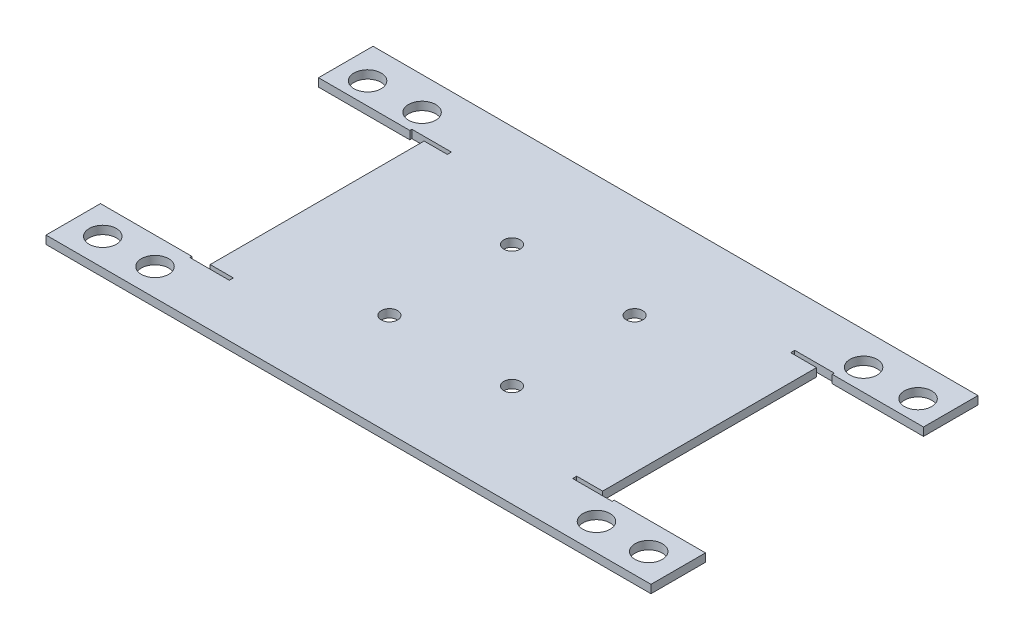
ISO-10303-21;
HEADER;
FILE_DESCRIPTION(('STEP AP214'),'2;1');
FILE_NAME('part.step','',(''),(''),'','','');
FILE_SCHEMA(('AUTOMOTIVE_DESIGN { 1 0 10303 214 1 1 1 1 }'));
ENDSEC;
DATA;
#1=APPLICATION_CONTEXT('core data for automotive mechanical design processes');
#2=APPLICATION_PROTOCOL_DEFINITION('international standard','automotive_design',2000,#1);
#3=PRODUCT_CONTEXT('',#1,'mechanical');
#4=PRODUCT('Part','Part','',(#3));
#5=PRODUCT_RELATED_PRODUCT_CATEGORY('part','',(#4));
#6=PRODUCT_DEFINITION_FORMATION('','',#4);
#7=PRODUCT_DEFINITION_CONTEXT('part definition',#1,'design');
#8=PRODUCT_DEFINITION('design','',#6,#7);
#9=PRODUCT_DEFINITION_SHAPE('','',#8);
#10=(LENGTH_UNIT() NAMED_UNIT(*) SI_UNIT(.MILLI.,.METRE.));
#11=(NAMED_UNIT(*) PLANE_ANGLE_UNIT() SI_UNIT($,.RADIAN.));
#12=(NAMED_UNIT(*) SI_UNIT($,.STERADIAN.) SOLID_ANGLE_UNIT());
#13=UNCERTAINTY_MEASURE_WITH_UNIT(LENGTH_MEASURE(1.E-05),#10,'distance_accuracy_value','');
#14=(GEOMETRIC_REPRESENTATION_CONTEXT(3) GLOBAL_UNCERTAINTY_ASSIGNED_CONTEXT((#13)) GLOBAL_UNIT_ASSIGNED_CONTEXT((#10,
#11,#12)) REPRESENTATION_CONTEXT('',''));
#15=CARTESIAN_POINT('',(0.,0.,0.));
#16=DIRECTION('',(0.,0.,1.));
#17=DIRECTION('',(1.,0.,0.));
#18=AXIS2_PLACEMENT_3D('',#15,#16,#17);
#19=CARTESIAN_POINT('',(0.,1.,0.));
#20=DIRECTION('',(0.,0.,-1.));
#21=DIRECTION('',(1.,0.,0.));
#22=AXIS2_PLACEMENT_3D('',#19,#20,#21);
#23=PLANE('',#22);
#24=DIRECTION('',(1.,0.,0.));
#25=VECTOR('',#24,1.);
#26=CARTESIAN_POINT('',(0.,1.,0.));
#27=LINE('',#26,#25);
#28=CARTESIAN_POINT('',(-19.7488935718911,1.,0.));
#29=VERTEX_POINT('',#28);
#30=CARTESIAN_POINT('',(91.2488935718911,1.,0.));
#31=VERTEX_POINT('',#30);
#32=EDGE_CURVE('E268',#29,#31,#27,.T.);
#33=ORIENTED_EDGE('',*,*,#32,.F.);
#34=DIRECTION('',(0.,1.,0.));
#35=VECTOR('',#34,1.);
#36=CARTESIAN_POINT('',(-19.7488935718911,1.,0.));
#37=LINE('',#36,#35);
#38=CARTESIAN_POINT('',(-19.7488935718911,-0.499999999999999,0.));
#39=VERTEX_POINT('',#38);
#40=EDGE_CURVE('E290',#39,#29,#37,.T.);
#41=ORIENTED_EDGE('',*,*,#40,.F.);
#42=DIRECTION('',(1.,0.,0.));
#43=VECTOR('',#42,1.);
#44=CARTESIAN_POINT('',(0.,-0.5,0.));
#45=LINE('',#44,#43);
#46=CARTESIAN_POINT('',(91.2488935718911,-0.5,0.));
#47=VERTEX_POINT('',#46);
#48=EDGE_CURVE('E142',#39,#47,#45,.T.);
#49=ORIENTED_EDGE('',*,*,#48,.T.);
#50=DIRECTION('',(0.,1.,0.));
#51=VECTOR('',#50,1.);
#52=CARTESIAN_POINT('',(91.2488935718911,1.,0.));
#53=LINE('',#52,#51);
#54=EDGE_CURVE('E407',#47,#31,#53,.T.);
#55=ORIENTED_EDGE('',*,*,#54,.T.);
#56=EDGE_LOOP('',(#33,#41,#49,#55));
#57=FACE_BOUND('',#56,.T.);
#58=ADVANCED_FACE('F43',(#57),#23,.F.);
#59=CARTESIAN_POINT('',(0.,1.,-9.625));
#60=DIRECTION('',(0.,0.,1.));
#61=DIRECTION('',(-1.,0.,0.));
#62=AXIS2_PLACEMENT_3D('',#59,#60,#61);
#63=PLANE('',#62);
#64=DIRECTION('',(-1.,0.,0.));
#65=VECTOR('',#64,1.);
#66=CARTESIAN_POINT('',(0.,1.,-9.625));
#67=LINE('',#66,#65);
#68=CARTESIAN_POINT('',(74.498893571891,1.,-9.625));
#69=VERTEX_POINT('',#68);
#70=CARTESIAN_POINT('',(67.25,1.,-9.625));
#71=VERTEX_POINT('',#70);
#72=EDGE_CURVE('E200',#69,#71,#67,.T.);
#73=ORIENTED_EDGE('',*,*,#72,.F.);
#74=DIRECTION('',(0.,1.,0.));
#75=VECTOR('',#74,1.);
#76=CARTESIAN_POINT('',(74.498893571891,1.,-9.625));
#77=LINE('',#76,#75);
#78=CARTESIAN_POINT('',(74.498893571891,-0.5,-9.625));
#79=VERTEX_POINT('',#78);
#80=EDGE_CURVE('E133',#79,#69,#77,.T.);
#81=ORIENTED_EDGE('',*,*,#80,.F.);
#82=DIRECTION('',(1.,0.,0.));
#83=VECTOR('',#82,1.);
#84=CARTESIAN_POINT('',(0.,-0.5,-9.625));
#85=LINE('',#84,#83);
#86=CARTESIAN_POINT('',(67.25,-0.5,-9.625));
#87=VERTEX_POINT('',#86);
#88=EDGE_CURVE('E125',#79,#87,#85,.F.);
#89=ORIENTED_EDGE('',*,*,#88,.T.);
#90=DIRECTION('',(0.,1.,0.));
#91=VECTOR('',#90,1.);
#92=CARTESIAN_POINT('',(67.25,1.,-9.625));
#93=LINE('',#92,#91);
#94=EDGE_CURVE('E12',#87,#71,#93,.T.);
#95=ORIENTED_EDGE('',*,*,#94,.T.);
#96=EDGE_LOOP('',(#73,#81,#89,#95));
#97=FACE_BOUND('',#96,.T.);
#98=ADVANCED_FACE('F131',(#97),#63,.F.);
#99=CARTESIAN_POINT('',(67.25,1.,0.));
#100=DIRECTION('',(-1.,0.,0.));
#101=DIRECTION('',(0.,0.,-1.));
#102=AXIS2_PLACEMENT_3D('',#99,#100,#101);
#103=PLANE('',#102);
#104=ORIENTED_EDGE('',*,*,#94,.F.);
#105=DIRECTION('',(0.,0.,-1.));
#106=VECTOR('',#105,1.);
#107=CARTESIAN_POINT('',(67.25,-0.5,0.));
#108=LINE('',#107,#106);
#109=CARTESIAN_POINT('',(67.25,-0.5,-10.375));
#110=VERTEX_POINT('',#109);
#111=EDGE_CURVE('E110',#87,#110,#108,.T.);
#112=ORIENTED_EDGE('',*,*,#111,.T.);
#113=DIRECTION('',(0.,1.,0.));
#114=VECTOR('',#113,1.);
#115=CARTESIAN_POINT('',(67.25,1.,-10.375));
#116=LINE('',#115,#114);
#117=CARTESIAN_POINT('',(67.25,1.,-10.375));
#118=VERTEX_POINT('',#117);
#119=EDGE_CURVE('E52',#110,#118,#116,.T.);
#120=ORIENTED_EDGE('',*,*,#119,.T.);
#121=DIRECTION('',(0.,0.,-1.));
#122=VECTOR('',#121,1.);
#123=CARTESIAN_POINT('',(67.25,1.,0.));
#124=LINE('',#123,#122);
#125=EDGE_CURVE('E113',#71,#118,#124,.T.);
#126=ORIENTED_EDGE('',*,*,#125,.F.);
#127=EDGE_LOOP('',(#104,#112,#120,#126));
#128=FACE_BOUND('',#127,.T.);
#129=ADVANCED_FACE('F109',(#128),#103,.F.);
#130=CARTESIAN_POINT('',(0.,1.,-10.375));
#131=DIRECTION('',(0.,0.,-1.));
#132=DIRECTION('',(1.,0.,0.));
#133=AXIS2_PLACEMENT_3D('',#130,#131,#132);
#134=PLANE('',#133);
#135=ORIENTED_EDGE('',*,*,#119,.F.);
#136=DIRECTION('',(1.,0.,0.));
#137=VECTOR('',#136,1.);
#138=CARTESIAN_POINT('',(0.,-0.5,-10.375));
#139=LINE('',#138,#137);
#140=CARTESIAN_POINT('',(72.,-0.5,-10.375));
#141=VERTEX_POINT('',#140);
#142=EDGE_CURVE('E128',#110,#141,#139,.T.);
#143=ORIENTED_EDGE('',*,*,#142,.T.);
#144=DIRECTION('',(0.,1.,0.));
#145=VECTOR('',#144,1.);
#146=CARTESIAN_POINT('',(72.,1.,-10.375));
#147=LINE('',#146,#145);
#148=CARTESIAN_POINT('',(72.,1.,-10.375));
#149=VERTEX_POINT('',#148);
#150=EDGE_CURVE('E186',#141,#149,#147,.T.);
#151=ORIENTED_EDGE('',*,*,#150,.T.);
#152=DIRECTION('',(1.,0.,0.));
#153=VECTOR('',#152,1.);
#154=CARTESIAN_POINT('',(0.,1.,-10.375));
#155=LINE('',#154,#153);
#156=EDGE_CURVE('E197',#118,#149,#155,.T.);
#157=ORIENTED_EDGE('',*,*,#156,.F.);
#158=EDGE_LOOP('',(#135,#143,#151,#157));
#159=FACE_BOUND('',#158,.T.);
#160=ADVANCED_FACE('F203',(#159),#134,.F.);
#161=CARTESIAN_POINT('',(72.,1.,0.));
#162=DIRECTION('',(-1.,0.,0.));
#163=DIRECTION('',(0.,0.,-1.));
#164=AXIS2_PLACEMENT_3D('',#161,#162,#163);
#165=PLANE('',#164);
#166=ORIENTED_EDGE('',*,*,#150,.F.);
#167=DIRECTION('',(0.,0.,-1.));
#168=VECTOR('',#167,1.);
#169=CARTESIAN_POINT('',(72.,-0.5,0.));
#170=LINE('',#169,#168);
#171=CARTESIAN_POINT('',(72.,-0.5,-49.625));
#172=VERTEX_POINT('',#171);
#173=EDGE_CURVE('E160',#141,#172,#170,.T.);
#174=ORIENTED_EDGE('',*,*,#173,.T.);
#175=DIRECTION('',(0.,1.,0.));
#176=VECTOR('',#175,1.);
#177=CARTESIAN_POINT('',(72.,1.,-49.625));
#178=LINE('',#177,#176);
#179=CARTESIAN_POINT('',(72.,1.,-49.625));
#180=VERTEX_POINT('',#179);
#181=EDGE_CURVE('E183',#172,#180,#178,.T.);
#182=ORIENTED_EDGE('',*,*,#181,.T.);
#183=DIRECTION('',(0.,0.,-1.));
#184=VECTOR('',#183,1.);
#185=CARTESIAN_POINT('',(72.,1.,0.));
#186=LINE('',#185,#184);
#187=EDGE_CURVE('E277',#149,#180,#186,.T.);
#188=ORIENTED_EDGE('',*,*,#187,.F.);
#189=EDGE_LOOP('',(#166,#174,#182,#188));
#190=FACE_BOUND('',#189,.T.);
#191=ADVANCED_FACE('F252',(#190),#165,.F.);
#192=CARTESIAN_POINT('',(0.,1.,-49.6249999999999));
#193=DIRECTION('',(0.,0.,1.));
#194=DIRECTION('',(-1.,0.,0.));
#195=AXIS2_PLACEMENT_3D('',#192,#193,#194);
#196=PLANE('',#195);
#197=ORIENTED_EDGE('',*,*,#181,.F.);
#198=DIRECTION('',(1.,0.,0.));
#199=VECTOR('',#198,1.);
#200=CARTESIAN_POINT('',(0.,-0.5,-49.625));
#201=LINE('',#200,#199);
#202=CARTESIAN_POINT('',(67.25,-0.5,-49.625));
#203=VERTEX_POINT('',#202);
#204=EDGE_CURVE('E129',#172,#203,#201,.F.);
#205=ORIENTED_EDGE('',*,*,#204,.T.);
#206=DIRECTION('',(0.,1.,0.));
#207=VECTOR('',#206,1.);
#208=CARTESIAN_POINT('',(67.25,1.,-49.625));
#209=LINE('',#208,#207);
#210=CARTESIAN_POINT('',(67.25,1.,-49.625));
#211=VERTEX_POINT('',#210);
#212=EDGE_CURVE('E180',#203,#211,#209,.T.);
#213=ORIENTED_EDGE('',*,*,#212,.T.);
#214=DIRECTION('',(-1.,0.,0.));
#215=VECTOR('',#214,1.);
#216=CARTESIAN_POINT('',(0.,1.,-49.6249999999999));
#217=LINE('',#216,#215);
#218=EDGE_CURVE('E201',#180,#211,#217,.T.);
#219=ORIENTED_EDGE('',*,*,#218,.F.);
#220=EDGE_LOOP('',(#197,#205,#213,#219));
#221=FACE_BOUND('',#220,.T.);
#222=ADVANCED_FACE('F256',(#221),#196,.F.);
#223=CARTESIAN_POINT('',(67.2500000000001,1.,0.));
#224=DIRECTION('',(-1.,0.,0.));
#225=DIRECTION('',(0.,0.,-1.));
#226=AXIS2_PLACEMENT_3D('',#223,#224,#225);
#227=PLANE('',#226);
#228=ORIENTED_EDGE('',*,*,#212,.F.);
#229=DIRECTION('',(0.,0.,-1.));
#230=VECTOR('',#229,1.);
#231=CARTESIAN_POINT('',(67.25,-0.5,0.));
#232=LINE('',#231,#230);
#233=CARTESIAN_POINT('',(67.25,-0.5,-50.375));
#234=VERTEX_POINT('',#233);
#235=EDGE_CURVE('E145',#203,#234,#232,.T.);
#236=ORIENTED_EDGE('',*,*,#235,.T.);
#237=DIRECTION('',(0.,1.,0.));
#238=VECTOR('',#237,1.);
#239=CARTESIAN_POINT('',(67.25,1.,-50.375));
#240=LINE('',#239,#238);
#241=CARTESIAN_POINT('',(67.25,1.,-50.375));
#242=VERTEX_POINT('',#241);
#243=EDGE_CURVE('E177',#234,#242,#240,.T.);
#244=ORIENTED_EDGE('',*,*,#243,.T.);
#245=DIRECTION('',(0.,0.,-1.));
#246=VECTOR('',#245,1.);
#247=CARTESIAN_POINT('',(67.2500000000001,1.,0.));
#248=LINE('',#247,#246);
#249=EDGE_CURVE('E265',#211,#242,#248,.T.);
#250=ORIENTED_EDGE('',*,*,#249,.F.);
#251=EDGE_LOOP('',(#228,#236,#244,#250));
#252=FACE_BOUND('',#251,.T.);
#253=ADVANCED_FACE('F724',(#252),#227,.F.);
#254=CARTESIAN_POINT('',(0.,1.,-50.3749999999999));
#255=DIRECTION('',(0.,0.,-1.));
#256=DIRECTION('',(1.,0.,0.));
#257=AXIS2_PLACEMENT_3D('',#254,#255,#256);
#258=PLANE('',#257);
#259=ORIENTED_EDGE('',*,*,#243,.F.);
#260=DIRECTION('',(1.,0.,0.));
#261=VECTOR('',#260,1.);
#262=CARTESIAN_POINT('',(0.,-0.5,-50.375));
#263=LINE('',#262,#261);
#264=CARTESIAN_POINT('',(74.498893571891,-0.5,-50.375));
#265=VERTEX_POINT('',#264);
#266=EDGE_CURVE('E243',#234,#265,#263,.T.);
#267=ORIENTED_EDGE('',*,*,#266,.T.);
#268=DIRECTION('',(0.,1.,0.));
#269=VECTOR('',#268,1.);
#270=CARTESIAN_POINT('',(74.498893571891,1.,-50.375));
#271=LINE('',#270,#269);
#272=CARTESIAN_POINT('',(74.498893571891,1.,-50.375));
#273=VERTEX_POINT('',#272);
#274=EDGE_CURVE('E445',#265,#273,#271,.T.);
#275=ORIENTED_EDGE('',*,*,#274,.T.);
#276=DIRECTION('',(1.,0.,0.));
#277=VECTOR('',#276,1.);
#278=CARTESIAN_POINT('',(0.,1.,-50.3749999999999));
#279=LINE('',#278,#277);
#280=EDGE_CURVE('E263',#242,#273,#279,.T.);
#281=ORIENTED_EDGE('',*,*,#280,.F.);
#282=EDGE_LOOP('',(#259,#267,#275,#281));
#283=FACE_BOUND('',#282,.T.);
#284=ADVANCED_FACE('F473',(#283),#258,.F.);
#285=CARTESIAN_POINT('',(0.,1.,-60.));
#286=DIRECTION('',(0.,0.,1.));
#287=DIRECTION('',(-1.,0.,0.));
#288=AXIS2_PLACEMENT_3D('',#285,#286,#287);
#289=PLANE('',#288);
#290=DIRECTION('',(-1.,0.,0.));
#291=VECTOR('',#290,1.);
#292=CARTESIAN_POINT('',(0.,1.,-60.));
#293=LINE('',#292,#291);
#294=CARTESIAN_POINT('',(91.248893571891,1.,-60.));
#295=VERTEX_POINT('',#294);
#296=CARTESIAN_POINT('',(-19.7488935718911,1.,-60.));
#297=VERTEX_POINT('',#296);
#298=EDGE_CURVE('E274',#295,#297,#293,.T.);
#299=ORIENTED_EDGE('',*,*,#298,.F.);
#300=DIRECTION('',(0.,1.,0.));
#301=VECTOR('',#300,1.);
#302=CARTESIAN_POINT('',(91.248893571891,1.,-60.));
#303=LINE('',#302,#301);
#304=CARTESIAN_POINT('',(91.248893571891,-0.5,-60.));
#305=VERTEX_POINT('',#304);
#306=EDGE_CURVE('E412',#305,#295,#303,.T.);
#307=ORIENTED_EDGE('',*,*,#306,.F.);
#308=DIRECTION('',(1.,0.,0.));
#309=VECTOR('',#308,1.);
#310=CARTESIAN_POINT('',(0.,-0.5,-60.));
#311=LINE('',#310,#309);
#312=CARTESIAN_POINT('',(-19.7488935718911,-0.499999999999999,-60.));
#313=VERTEX_POINT('',#312);
#314=EDGE_CURVE('E236',#305,#313,#311,.F.);
#315=ORIENTED_EDGE('',*,*,#314,.T.);
#316=DIRECTION('',(0.,1.,0.));
#317=VECTOR('',#316,1.);
#318=CARTESIAN_POINT('',(-19.7488935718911,1.,-60.));
#319=LINE('',#318,#317);
#320=EDGE_CURVE('E369',#313,#297,#319,.T.);
#321=ORIENTED_EDGE('',*,*,#320,.T.);
#322=EDGE_LOOP('',(#299,#307,#315,#321));
#323=FACE_BOUND('',#322,.T.);
#324=ADVANCED_FACE('F717',(#323),#289,.F.);
#325=CARTESIAN_POINT('',(0.,1.,-50.375));
#326=DIRECTION('',(0.,0.,-1.));
#327=DIRECTION('',(1.,0.,0.));
#328=AXIS2_PLACEMENT_3D('',#325,#326,#327);
#329=PLANE('',#328);
#330=DIRECTION('',(1.,0.,0.));
#331=VECTOR('',#330,1.);
#332=CARTESIAN_POINT('',(0.,1.,-50.375));
#333=LINE('',#332,#331);
#334=CARTESIAN_POINT('',(-2.99889357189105,1.,-50.375));
#335=VERTEX_POINT('',#334);
#336=CARTESIAN_POINT('',(4.24999999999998,1.,-50.375));
#337=VERTEX_POINT('',#336);
#338=EDGE_CURVE('E214',#335,#337,#333,.T.);
#339=ORIENTED_EDGE('',*,*,#338,.F.);
#340=DIRECTION('',(0.,1.,0.));
#341=VECTOR('',#340,1.);
#342=CARTESIAN_POINT('',(-2.99889357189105,1.,-50.375));
#343=LINE('',#342,#341);
#344=CARTESIAN_POINT('',(-2.99889357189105,-0.5,-50.375));
#345=VERTEX_POINT('',#344);
#346=EDGE_CURVE('E335',#345,#335,#343,.T.);
#347=ORIENTED_EDGE('',*,*,#346,.F.);
#348=DIRECTION('',(1.,0.,0.));
#349=VECTOR('',#348,1.);
#350=CARTESIAN_POINT('',(0.,-0.5,-50.375));
#351=LINE('',#350,#349);
#352=CARTESIAN_POINT('',(4.24999999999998,-0.5,-50.375));
#353=VERTEX_POINT('',#352);
#354=EDGE_CURVE('E230',#345,#353,#351,.T.);
#355=ORIENTED_EDGE('',*,*,#354,.T.);
#356=DIRECTION('',(0.,1.,0.));
#357=VECTOR('',#356,1.);
#358=CARTESIAN_POINT('',(4.24999999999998,1.,-50.375));
#359=LINE('',#358,#357);
#360=EDGE_CURVE('E174',#353,#337,#359,.T.);
#361=ORIENTED_EDGE('',*,*,#360,.T.);
#362=EDGE_LOOP('',(#339,#347,#355,#361));
#363=FACE_BOUND('',#362,.T.);
#364=ADVANCED_FACE('F713',(#363),#329,.F.);
#365=CARTESIAN_POINT('',(4.24999999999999,1.,0.));
#366=DIRECTION('',(1.,0.,0.));
#367=DIRECTION('',(0.,0.,1.));
#368=AXIS2_PLACEMENT_3D('',#365,#366,#367);
#369=PLANE('',#368);
#370=ORIENTED_EDGE('',*,*,#360,.F.);
#371=DIRECTION('',(0.,0.,-1.));
#372=VECTOR('',#371,1.);
#373=CARTESIAN_POINT('',(4.24999999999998,-0.5,0.));
#374=LINE('',#373,#372);
#375=CARTESIAN_POINT('',(4.24999999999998,-0.5,-49.625));
#376=VERTEX_POINT('',#375);
#377=EDGE_CURVE('E135',#353,#376,#374,.F.);
#378=ORIENTED_EDGE('',*,*,#377,.T.);
#379=DIRECTION('',(0.,1.,0.));
#380=VECTOR('',#379,1.);
#381=CARTESIAN_POINT('',(4.24999999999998,1.,-49.625));
#382=LINE('',#381,#380);
#383=CARTESIAN_POINT('',(4.24999999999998,1.,-49.625));
#384=VERTEX_POINT('',#383);
#385=EDGE_CURVE('E171',#376,#384,#382,.T.);
#386=ORIENTED_EDGE('',*,*,#385,.T.);
#387=DIRECTION('',(0.,0.,1.));
#388=VECTOR('',#387,1.);
#389=CARTESIAN_POINT('',(4.24999999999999,1.,0.));
#390=LINE('',#389,#388);
#391=EDGE_CURVE('E205',#337,#384,#390,.T.);
#392=ORIENTED_EDGE('',*,*,#391,.F.);
#393=EDGE_LOOP('',(#370,#378,#386,#392));
#394=FACE_BOUND('',#393,.T.);
#395=ADVANCED_FACE('F709',(#394),#369,.F.);
#396=CARTESIAN_POINT('',(0.,1.,-49.625));
#397=DIRECTION('',(0.,0.,1.));
#398=DIRECTION('',(-1.,0.,0.));
#399=AXIS2_PLACEMENT_3D('',#396,#397,#398);
#400=PLANE('',#399);
#401=ORIENTED_EDGE('',*,*,#385,.F.);
#402=DIRECTION('',(1.,0.,0.));
#403=VECTOR('',#402,1.);
#404=CARTESIAN_POINT('',(0.,-0.5,-49.625));
#405=LINE('',#404,#403);
#406=CARTESIAN_POINT('',(0.,-0.5,-49.625));
#407=VERTEX_POINT('',#406);
#408=EDGE_CURVE('E138',#376,#407,#405,.F.);
#409=ORIENTED_EDGE('',*,*,#408,.T.);
#410=DIRECTION('',(0.,1.,0.));
#411=VECTOR('',#410,1.);
#412=CARTESIAN_POINT('',(0.,1.,-49.625));
#413=LINE('',#412,#411);
#414=CARTESIAN_POINT('',(0.,1.,-49.625));
#415=VERTEX_POINT('',#414);
#416=EDGE_CURVE('E168',#407,#415,#413,.T.);
#417=ORIENTED_EDGE('',*,*,#416,.T.);
#418=DIRECTION('',(-1.,0.,0.));
#419=VECTOR('',#418,1.);
#420=CARTESIAN_POINT('',(0.,1.,-49.625));
#421=LINE('',#420,#419);
#422=EDGE_CURVE('E211',#384,#415,#421,.T.);
#423=ORIENTED_EDGE('',*,*,#422,.F.);
#424=EDGE_LOOP('',(#401,#409,#417,#423));
#425=FACE_BOUND('',#424,.T.);
#426=ADVANCED_FACE('F706',(#425),#400,.F.);
#427=CARTESIAN_POINT('',(0.,1.,0.));
#428=DIRECTION('',(1.,0.,0.));
#429=DIRECTION('',(0.,0.,1.));
#430=AXIS2_PLACEMENT_3D('',#427,#428,#429);
#431=PLANE('',#430);
#432=ORIENTED_EDGE('',*,*,#416,.F.);
#433=DIRECTION('',(0.,0.,-1.));
#434=VECTOR('',#433,1.);
#435=CARTESIAN_POINT('',(0.,-0.5,0.));
#436=LINE('',#435,#434);
#437=CARTESIAN_POINT('',(0.,-0.5,-10.375));
#438=VERTEX_POINT('',#437);
#439=EDGE_CURVE('E146',#407,#438,#436,.F.);
#440=ORIENTED_EDGE('',*,*,#439,.T.);
#441=DIRECTION('',(0.,1.,0.));
#442=VECTOR('',#441,1.);
#443=CARTESIAN_POINT('',(0.,1.,-10.375));
#444=LINE('',#443,#442);
#445=CARTESIAN_POINT('',(0.,1.,-10.375));
#446=VERTEX_POINT('',#445);
#447=EDGE_CURVE('E165',#438,#446,#444,.T.);
#448=ORIENTED_EDGE('',*,*,#447,.T.);
#449=DIRECTION('',(0.,0.,1.));
#450=VECTOR('',#449,1.);
#451=CARTESIAN_POINT('',(0.,1.,0.));
#452=LINE('',#451,#450);
#453=EDGE_CURVE('E271',#415,#446,#452,.T.);
#454=ORIENTED_EDGE('',*,*,#453,.F.);
#455=EDGE_LOOP('',(#432,#440,#448,#454));
#456=FACE_BOUND('',#455,.T.);
#457=ADVANCED_FACE('F551',(#456),#431,.F.);
#458=CARTESIAN_POINT('',(0.,1.,-10.375));
#459=DIRECTION('',(0.,0.,-1.));
#460=DIRECTION('',(1.,0.,0.));
#461=AXIS2_PLACEMENT_3D('',#458,#459,#460);
#462=PLANE('',#461);
#463=ORIENTED_EDGE('',*,*,#447,.F.);
#464=DIRECTION('',(1.,0.,0.));
#465=VECTOR('',#464,1.);
#466=CARTESIAN_POINT('',(0.,-0.5,-10.375));
#467=LINE('',#466,#465);
#468=CARTESIAN_POINT('',(4.24999999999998,-0.5,-10.375));
#469=VERTEX_POINT('',#468);
#470=EDGE_CURVE('E227',#438,#469,#467,.T.);
#471=ORIENTED_EDGE('',*,*,#470,.T.);
#472=DIRECTION('',(0.,1.,0.));
#473=VECTOR('',#472,1.);
#474=CARTESIAN_POINT('',(4.24999999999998,1.,-10.375));
#475=LINE('',#474,#473);
#476=CARTESIAN_POINT('',(4.24999999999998,1.,-10.375));
#477=VERTEX_POINT('',#476);
#478=EDGE_CURVE('E162',#469,#477,#475,.T.);
#479=ORIENTED_EDGE('',*,*,#478,.T.);
#480=DIRECTION('',(1.,0.,0.));
#481=VECTOR('',#480,1.);
#482=CARTESIAN_POINT('',(0.,1.,-10.375));
#483=LINE('',#482,#481);
#484=EDGE_CURVE('E163',#446,#477,#483,.T.);
#485=ORIENTED_EDGE('',*,*,#484,.F.);
#486=EDGE_LOOP('',(#463,#471,#479,#485));
#487=FACE_BOUND('',#486,.T.);
#488=ADVANCED_FACE('F557',(#487),#462,.F.);
#489=CARTESIAN_POINT('',(4.24999999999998,1.,0.));
#490=DIRECTION('',(1.,0.,0.));
#491=DIRECTION('',(0.,0.,1.));
#492=AXIS2_PLACEMENT_3D('',#489,#490,#491);
#493=PLANE('',#492);
#494=ORIENTED_EDGE('',*,*,#478,.F.);
#495=DIRECTION('',(0.,0.,-1.));
#496=VECTOR('',#495,1.);
#497=CARTESIAN_POINT('',(4.24999999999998,-0.5,0.));
#498=LINE('',#497,#496);
#499=CARTESIAN_POINT('',(4.24999999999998,-0.5,-9.625));
#500=VERTEX_POINT('',#499);
#501=EDGE_CURVE('E228',#469,#500,#498,.F.);
#502=ORIENTED_EDGE('',*,*,#501,.T.);
#503=DIRECTION('',(0.,1.,0.));
#504=VECTOR('',#503,1.);
#505=CARTESIAN_POINT('',(4.24999999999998,1.,-9.625));
#506=LINE('',#505,#504);
#507=CARTESIAN_POINT('',(4.24999999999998,1.,-9.625));
#508=VERTEX_POINT('',#507);
#509=EDGE_CURVE('E60',#500,#508,#506,.T.);
#510=ORIENTED_EDGE('',*,*,#509,.T.);
#511=DIRECTION('',(0.,0.,1.));
#512=VECTOR('',#511,1.);
#513=CARTESIAN_POINT('',(4.24999999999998,1.,0.));
#514=LINE('',#513,#512);
#515=EDGE_CURVE('E217',#477,#508,#514,.T.);
#516=ORIENTED_EDGE('',*,*,#515,.F.);
#517=EDGE_LOOP('',(#494,#502,#510,#516));
#518=FACE_BOUND('',#517,.T.);
#519=ADVANCED_FACE('F559',(#518),#493,.F.);
#520=CARTESIAN_POINT('',(0.,1.,-9.625));
#521=DIRECTION('',(0.,0.,1.));
#522=DIRECTION('',(-1.,0.,0.));
#523=AXIS2_PLACEMENT_3D('',#520,#521,#522);
#524=PLANE('',#523);
#525=ORIENTED_EDGE('',*,*,#509,.F.);
#526=DIRECTION('',(1.,0.,0.));
#527=VECTOR('',#526,1.);
#528=CARTESIAN_POINT('',(0.,-0.5,-9.625));
#529=LINE('',#528,#527);
#530=CARTESIAN_POINT('',(-2.99889357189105,-0.5,-9.625));
#531=VERTEX_POINT('',#530);
#532=EDGE_CURVE('E224',#500,#531,#529,.F.);
#533=ORIENTED_EDGE('',*,*,#532,.T.);
#534=DIRECTION('',(0.,1.,0.));
#535=VECTOR('',#534,1.);
#536=CARTESIAN_POINT('',(-2.99889357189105,1.,-9.625));
#537=LINE('',#536,#535);
#538=CARTESIAN_POINT('',(-2.99889357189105,1.,-9.625));
#539=VERTEX_POINT('',#538);
#540=EDGE_CURVE('E324',#531,#539,#537,.T.);
#541=ORIENTED_EDGE('',*,*,#540,.T.);
#542=DIRECTION('',(-1.,0.,0.));
#543=VECTOR('',#542,1.);
#544=CARTESIAN_POINT('',(0.,1.,-9.625));
#545=LINE('',#544,#543);
#546=EDGE_CURVE('E219',#508,#539,#545,.T.);
#547=ORIENTED_EDGE('',*,*,#546,.F.);
#548=EDGE_LOOP('',(#525,#533,#541,#547));
#549=FACE_BOUND('',#548,.T.);
#550=ADVANCED_FACE('F564',(#549),#524,.F.);
#551=CARTESIAN_POINT('',(24.5070021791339,1.,-18.7570021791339));
#552=DIRECTION('',(0.,-1.,0.));
#553=DIRECTION('',(0.,0.,-1.));
#554=AXIS2_PLACEMENT_3D('',#551,#552,#553);
#555=CYLINDRICAL_SURFACE('',#554,1.5);
#556=CARTESIAN_POINT('',(24.5070021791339,1.,-18.7570021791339));
#557=DIRECTION('',(0.,1.,0.));
#558=DIRECTION('',(0.,0.,1.));
#559=AXIS2_PLACEMENT_3D('',#556,#557,#558);
#560=CIRCLE('',#559,1.5);
#561=CARTESIAN_POINT('',(24.5070021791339,1.,-17.2570021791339));
#562=VERTEX_POINT('',#561);
#563=EDGE_CURVE('E233',#562,#562,#560,.T.);
#564=ORIENTED_EDGE('',*,*,#563,.T.);
#565=EDGE_LOOP('',(#564));
#566=FACE_BOUND('',#565,.T.);
#567=CARTESIAN_POINT('',(24.5070021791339,-0.5,-18.7570021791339));
#568=DIRECTION('',(0.,1.,0.));
#569=DIRECTION('',(0.,0.,1.));
#570=AXIS2_PLACEMENT_3D('',#567,#568,#569);
#571=CIRCLE('',#570,1.5);
#572=CARTESIAN_POINT('',(24.5070021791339,-0.5,-17.2570021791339));
#573=VERTEX_POINT('',#572);
#574=EDGE_CURVE('E147',#573,#573,#571,.T.);
#575=ORIENTED_EDGE('',*,*,#574,.F.);
#576=EDGE_LOOP('',(#575));
#577=FACE_BOUND('',#576,.T.);
#578=ADVANCED_FACE('F608',(#566,#577),#555,.F.);
#579=CARTESIAN_POINT('',(46.9929978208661,1.,-18.7570021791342));
#580=DIRECTION('',(0.,-1.,0.));
#581=DIRECTION('',(0.,0.,-1.));
#582=AXIS2_PLACEMENT_3D('',#579,#580,#581);
#583=CYLINDRICAL_SURFACE('',#582,1.5);
#584=CARTESIAN_POINT('',(46.9929978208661,1.,-18.7570021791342));
#585=DIRECTION('',(0.,1.,0.));
#586=DIRECTION('',(0.,0.,1.));
#587=AXIS2_PLACEMENT_3D('',#584,#585,#586);
#588=CIRCLE('',#587,1.5);
#589=CARTESIAN_POINT('',(46.9929978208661,1.,-17.2570021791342));
#590=VERTEX_POINT('',#589);
#591=EDGE_CURVE('E285',#590,#590,#588,.T.);
#592=ORIENTED_EDGE('',*,*,#591,.T.);
#593=EDGE_LOOP('',(#592));
#594=FACE_BOUND('',#593,.T.);
#595=CARTESIAN_POINT('',(46.9929978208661,-0.5,-18.7570021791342));
#596=DIRECTION('',(0.,1.,0.));
#597=DIRECTION('',(0.,0.,1.));
#598=AXIS2_PLACEMENT_3D('',#595,#596,#597);
#599=CIRCLE('',#598,1.5);
#600=CARTESIAN_POINT('',(46.9929978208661,-0.5,-17.2570021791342));
#601=VERTEX_POINT('',#600);
#602=EDGE_CURVE('E150',#601,#601,#599,.T.);
#603=ORIENTED_EDGE('',*,*,#602,.F.);
#604=EDGE_LOOP('',(#603));
#605=FACE_BOUND('',#604,.T.);
#606=ADVANCED_FACE('F611',(#594,#605),#583,.F.);
#607=CARTESIAN_POINT('',(46.9929978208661,1.,-41.2429978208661));
#608=DIRECTION('',(0.,-1.,0.));
#609=DIRECTION('',(0.,0.,-1.));
#610=AXIS2_PLACEMENT_3D('',#607,#608,#609);
#611=CYLINDRICAL_SURFACE('',#610,1.5);
#612=CARTESIAN_POINT('',(46.9929978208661,1.,-41.2429978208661));
#613=DIRECTION('',(0.,1.,0.));
#614=DIRECTION('',(0.,0.,1.));
#615=AXIS2_PLACEMENT_3D('',#612,#613,#614);
#616=CIRCLE('',#615,1.5);
#617=CARTESIAN_POINT('',(46.9929978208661,1.,-39.7429978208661));
#618=VERTEX_POINT('',#617);
#619=EDGE_CURVE('E282',#618,#618,#616,.T.);
#620=ORIENTED_EDGE('',*,*,#619,.T.);
#621=EDGE_LOOP('',(#620));
#622=FACE_BOUND('',#621,.T.);
#623=CARTESIAN_POINT('',(46.9929978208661,-0.5,-41.2429978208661));
#624=DIRECTION('',(0.,1.,0.));
#625=DIRECTION('',(0.,0.,1.));
#626=AXIS2_PLACEMENT_3D('',#623,#624,#625);
#627=CIRCLE('',#626,1.5);
#628=CARTESIAN_POINT('',(46.9929978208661,-0.5,-39.7429978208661));
#629=VERTEX_POINT('',#628);
#630=EDGE_CURVE('E154',#629,#629,#627,.T.);
#631=ORIENTED_EDGE('',*,*,#630,.F.);
#632=EDGE_LOOP('',(#631));
#633=FACE_BOUND('',#632,.T.);
#634=ADVANCED_FACE('F615',(#622,#633),#611,.F.);
#635=CARTESIAN_POINT('',(24.5070021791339,1.,-41.242997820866));
#636=DIRECTION('',(0.,-1.,0.));
#637=DIRECTION('',(0.,0.,-1.));
#638=AXIS2_PLACEMENT_3D('',#635,#636,#637);
#639=CYLINDRICAL_SURFACE('',#638,1.5);
#640=CARTESIAN_POINT('',(24.5070021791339,1.,-41.242997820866));
#641=DIRECTION('',(0.,1.,0.));
#642=DIRECTION('',(0.,0.,1.));
#643=AXIS2_PLACEMENT_3D('',#640,#641,#642);
#644=CIRCLE('',#643,1.5);
#645=CARTESIAN_POINT('',(24.5070021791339,1.,-39.742997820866));
#646=VERTEX_POINT('',#645);
#647=EDGE_CURVE('E279',#646,#646,#644,.T.);
#648=ORIENTED_EDGE('',*,*,#647,.T.);
#649=EDGE_LOOP('',(#648));
#650=FACE_BOUND('',#649,.T.);
#651=CARTESIAN_POINT('',(24.5070021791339,-0.5,-41.242997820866));
#652=DIRECTION('',(0.,1.,0.));
#653=DIRECTION('',(0.,0.,1.));
#654=AXIS2_PLACEMENT_3D('',#651,#652,#653);
#655=CIRCLE('',#654,1.5);
#656=CARTESIAN_POINT('',(24.5070021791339,-0.5,-39.742997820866));
#657=VERTEX_POINT('',#656);
#658=EDGE_CURVE('E157',#657,#657,#655,.T.);
#659=ORIENTED_EDGE('',*,*,#658,.F.);
#660=EDGE_LOOP('',(#659));
#661=FACE_BOUND('',#660,.T.);
#662=ADVANCED_FACE('F618',(#650,#661),#639,.F.);
#663=CARTESIAN_POINT('',(0.,1.,0.));
#664=DIRECTION('',(0.,-1.,0.));
#665=DIRECTION('',(0.,0.,-1.));
#666=AXIS2_PLACEMENT_3D('',#663,#664,#665);
#667=PLANE('',#666);
#668=ORIENTED_EDGE('',*,*,#280,.T.);
#669=DIRECTION('',(0.,0.,1.));
#670=VECTOR('',#669,1.);
#671=CARTESIAN_POINT('',(74.498893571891,1.,-60.));
#672=LINE('',#671,#670);
#673=CARTESIAN_POINT('',(74.498893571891,1.,-50.));
#674=VERTEX_POINT('',#673);
#675=EDGE_CURVE('E442',#273,#674,#672,.T.);
#676=ORIENTED_EDGE('',*,*,#675,.T.);
#677=DIRECTION('',(-1.,0.,0.));
#678=VECTOR('',#677,1.);
#679=CARTESIAN_POINT('',(91.2488935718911,1.,-50.));
#680=LINE('',#679,#678);
#681=CARTESIAN_POINT('',(91.2488935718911,1.,-50.));
#682=VERTEX_POINT('',#681);
#683=EDGE_CURVE('E421',#682,#674,#680,.T.);
#684=ORIENTED_EDGE('',*,*,#683,.F.);
#685=DIRECTION('',(0.,0.,1.));
#686=VECTOR('',#685,1.);
#687=CARTESIAN_POINT('',(91.248893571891,1.,-60.));
#688=LINE('',#687,#686);
#689=EDGE_CURVE('E415',#295,#682,#688,.T.);
#690=ORIENTED_EDGE('',*,*,#689,.F.);
#691=ORIENTED_EDGE('',*,*,#298,.T.);
#692=DIRECTION('',(0.,0.,-1.));
#693=VECTOR('',#692,1.);
#694=CARTESIAN_POINT('',(-19.7488935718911,1.,-60.));
#695=LINE('',#694,#693);
#696=CARTESIAN_POINT('',(-19.7488935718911,1.,-50.));
#697=VERTEX_POINT('',#696);
#698=EDGE_CURVE('E348',#697,#297,#695,.T.);
#699=ORIENTED_EDGE('',*,*,#698,.F.);
#700=DIRECTION('',(1.,0.,0.));
#701=VECTOR('',#700,1.);
#702=CARTESIAN_POINT('',(-19.7488935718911,1.,-50.));
#703=LINE('',#702,#701);
#704=CARTESIAN_POINT('',(-2.99889357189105,1.,-50.));
#705=VERTEX_POINT('',#704);
#706=EDGE_CURVE('E363',#697,#705,#703,.T.);
#707=ORIENTED_EDGE('',*,*,#706,.T.);
#708=DIRECTION('',(0.,0.,-1.));
#709=VECTOR('',#708,1.);
#710=CARTESIAN_POINT('',(-2.99889357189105,1.,-60.));
#711=LINE('',#710,#709);
#712=EDGE_CURVE('E366',#705,#335,#711,.T.);
#713=ORIENTED_EDGE('',*,*,#712,.T.);
#714=ORIENTED_EDGE('',*,*,#338,.T.);
#715=ORIENTED_EDGE('',*,*,#391,.T.);
#716=ORIENTED_EDGE('',*,*,#422,.T.);
#717=ORIENTED_EDGE('',*,*,#453,.T.);
#718=ORIENTED_EDGE('',*,*,#484,.T.);
#719=ORIENTED_EDGE('',*,*,#515,.T.);
#720=ORIENTED_EDGE('',*,*,#546,.T.);
#721=DIRECTION('',(0.,0.,-1.));
#722=VECTOR('',#721,1.);
#723=CARTESIAN_POINT('',(-2.99889357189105,1.,0.));
#724=LINE('',#723,#722);
#725=CARTESIAN_POINT('',(-2.99889357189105,1.,-10.));
#726=VERTEX_POINT('',#725);
#727=EDGE_CURVE('E321',#539,#726,#724,.T.);
#728=ORIENTED_EDGE('',*,*,#727,.T.);
#729=DIRECTION('',(1.,0.,0.));
#730=VECTOR('',#729,1.);
#731=CARTESIAN_POINT('',(-19.7488935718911,1.,-10.));
#732=LINE('',#731,#730);
#733=CARTESIAN_POINT('',(-19.7488935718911,1.,-10.));
#734=VERTEX_POINT('',#733);
#735=EDGE_CURVE('E300',#734,#726,#732,.T.);
#736=ORIENTED_EDGE('',*,*,#735,.F.);
#737=DIRECTION('',(0.,0.,-1.));
#738=VECTOR('',#737,1.);
#739=CARTESIAN_POINT('',(-19.7488935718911,1.,0.));
#740=LINE('',#739,#738);
#741=EDGE_CURVE('E293',#29,#734,#740,.T.);
#742=ORIENTED_EDGE('',*,*,#741,.F.);
#743=ORIENTED_EDGE('',*,*,#32,.T.);
#744=DIRECTION('',(0.,0.,1.));
#745=VECTOR('',#744,1.);
#746=CARTESIAN_POINT('',(91.2488935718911,1.,0.));
#747=LINE('',#746,#745);
#748=CARTESIAN_POINT('',(91.2488935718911,1.,-10.));
#749=VERTEX_POINT('',#748);
#750=EDGE_CURVE('E387',#749,#31,#747,.T.);
#751=ORIENTED_EDGE('',*,*,#750,.F.);
#752=DIRECTION('',(-1.,0.,0.));
#753=VECTOR('',#752,1.);
#754=CARTESIAN_POINT('',(91.2488935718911,1.,-10.));
#755=LINE('',#754,#753);
#756=CARTESIAN_POINT('',(74.498893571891,1.,-10.));
#757=VERTEX_POINT('',#756);
#758=EDGE_CURVE('E402',#749,#757,#755,.T.);
#759=ORIENTED_EDGE('',*,*,#758,.T.);
#760=DIRECTION('',(0.,0.,1.));
#761=VECTOR('',#760,1.);
#762=CARTESIAN_POINT('',(74.498893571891,1.,0.));
#763=LINE('',#762,#761);
#764=EDGE_CURVE('E405',#757,#69,#763,.T.);
#765=ORIENTED_EDGE('',*,*,#764,.T.);
#766=ORIENTED_EDGE('',*,*,#72,.T.);
#767=ORIENTED_EDGE('',*,*,#125,.T.);
#768=ORIENTED_EDGE('',*,*,#156,.T.);
#769=ORIENTED_EDGE('',*,*,#187,.T.);
#770=ORIENTED_EDGE('',*,*,#218,.T.);
#771=ORIENTED_EDGE('',*,*,#249,.T.);
#772=EDGE_LOOP('',(#668,#676,#684,#690,#691,#699,#707,#713,#714,#715,#716,#717,#718,#719,#720,
#728,#736,#742,#743,#751,#759,#765,#766,#767,#768,#769,#770,#771));
#773=FACE_BOUND('',#772,.T.);
#774=ORIENTED_EDGE('',*,*,#563,.F.);
#775=EDGE_LOOP('',(#774));
#776=FACE_BOUND('',#775,.T.);
#777=ORIENTED_EDGE('',*,*,#591,.F.);
#778=EDGE_LOOP('',(#777));
#779=FACE_BOUND('',#778,.T.);
#780=ORIENTED_EDGE('',*,*,#619,.F.);
#781=EDGE_LOOP('',(#780));
#782=FACE_BOUND('',#781,.T.);
#783=ORIENTED_EDGE('',*,*,#647,.F.);
#784=EDGE_LOOP('',(#783));
#785=FACE_BOUND('',#784,.T.);
#786=CARTESIAN_POINT('',(-14.3314731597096,1.,-5.));
#787=DIRECTION('',(0.,-1.,0.));
#788=DIRECTION('',(0.,0.,1.));
#789=AXIS2_PLACEMENT_3D('',#786,#787,#788);
#790=CIRCLE('',#789,2.5);
#791=CARTESIAN_POINT('',(-14.3314731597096,1.,-2.5));
#792=VERTEX_POINT('',#791);
#793=EDGE_CURVE('E315',#792,#792,#790,.T.);
#794=ORIENTED_EDGE('',*,*,#793,.T.);
#795=EDGE_LOOP('',(#794));
#796=FACE_BOUND('',#795,.T.);
#797=CARTESIAN_POINT('',(-4.74889357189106,1.,-5.));
#798=DIRECTION('',(0.,-1.,0.));
#799=DIRECTION('',(0.,0.,1.));
#800=AXIS2_PLACEMENT_3D('',#797,#798,#799);
#801=CIRCLE('',#800,2.5);
#802=CARTESIAN_POINT('',(-4.74889357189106,1.,-2.5));
#803=VERTEX_POINT('',#802);
#804=EDGE_CURVE('E318',#803,#803,#801,.T.);
#805=ORIENTED_EDGE('',*,*,#804,.T.);
#806=EDGE_LOOP('',(#805));
#807=FACE_BOUND('',#806,.T.);
#808=CARTESIAN_POINT('',(-14.7488935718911,1.,-54.));
#809=DIRECTION('',(0.,-1.,0.));
#810=DIRECTION('',(0.,0.,1.));
#811=AXIS2_PLACEMENT_3D('',#808,#809,#810);
#812=CIRCLE('',#811,2.5);
#813=CARTESIAN_POINT('',(-14.7488935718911,1.,-51.5));
#814=VERTEX_POINT('',#813);
#815=EDGE_CURVE('E357',#814,#814,#812,.T.);
#816=ORIENTED_EDGE('',*,*,#815,.T.);
#817=EDGE_LOOP('',(#816));
#818=FACE_BOUND('',#817,.T.);
#819=CARTESIAN_POINT('',(-4.74889357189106,1.,-54.));
#820=DIRECTION('',(0.,-1.,0.));
#821=DIRECTION('',(0.,0.,1.));
#822=AXIS2_PLACEMENT_3D('',#819,#820,#821);
#823=CIRCLE('',#822,2.5);
#824=CARTESIAN_POINT('',(-4.74889357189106,1.,-51.5));
#825=VERTEX_POINT('',#824);
#826=EDGE_CURVE('E360',#825,#825,#823,.T.);
#827=ORIENTED_EDGE('',*,*,#826,.T.);
#828=EDGE_LOOP('',(#827));
#829=FACE_BOUND('',#828,.T.);
#830=CARTESIAN_POINT('',(85.8314731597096,1.,-5.));
#831=DIRECTION('',(0.,-1.,0.));
#832=DIRECTION('',(0.,0.,-1.));
#833=AXIS2_PLACEMENT_3D('',#830,#831,#832);
#834=CIRCLE('',#833,2.5);
#835=CARTESIAN_POINT('',(85.8314731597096,1.,-7.5));
#836=VERTEX_POINT('',#835);
#837=EDGE_CURVE('E396',#836,#836,#834,.T.);
#838=ORIENTED_EDGE('',*,*,#837,.T.);
#839=EDGE_LOOP('',(#838));
#840=FACE_BOUND('',#839,.T.);
#841=CARTESIAN_POINT('',(76.2488935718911,1.,-5.));
#842=DIRECTION('',(0.,-1.,0.));
#843=DIRECTION('',(0.,0.,-1.));
#844=AXIS2_PLACEMENT_3D('',#841,#842,#843);
#845=CIRCLE('',#844,2.5);
#846=CARTESIAN_POINT('',(76.2488935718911,1.,-7.5));
#847=VERTEX_POINT('',#846);
#848=EDGE_CURVE('E399',#847,#847,#845,.T.);
#849=ORIENTED_EDGE('',*,*,#848,.T.);
#850=EDGE_LOOP('',(#849));
#851=FACE_BOUND('',#850,.T.);
#852=CARTESIAN_POINT('',(86.248893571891,1.00000000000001,-54.));
#853=DIRECTION('',(0.,-1.,0.));
#854=DIRECTION('',(0.,0.,-1.));
#855=AXIS2_PLACEMENT_3D('',#852,#853,#854);
#856=CIRCLE('',#855,2.5);
#857=CARTESIAN_POINT('',(86.248893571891,1.00000000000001,-56.5));
#858=VERTEX_POINT('',#857);
#859=EDGE_CURVE('E436',#858,#858,#856,.T.);
#860=ORIENTED_EDGE('',*,*,#859,.T.);
#861=EDGE_LOOP('',(#860));
#862=FACE_BOUND('',#861,.T.);
#863=CARTESIAN_POINT('',(76.248893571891,1.00000000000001,-54.));
#864=DIRECTION('',(0.,-1.,0.));
#865=DIRECTION('',(0.,0.,-1.));
#866=AXIS2_PLACEMENT_3D('',#863,#864,#865);
#867=CIRCLE('',#866,2.5);
#868=CARTESIAN_POINT('',(76.248893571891,1.00000000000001,-56.5));
#869=VERTEX_POINT('',#868);
#870=EDGE_CURVE('E439',#869,#869,#867,.T.);
#871=ORIENTED_EDGE('',*,*,#870,.T.);
#872=EDGE_LOOP('',(#871));
#873=FACE_BOUND('',#872,.T.);
#874=ADVANCED_FACE('F45',(#773,#776,#779,#782,#785,#796,#807,#818,#829,#840,#851,#862,#873),
#667,.F.);
#875=CARTESIAN_POINT('',(0.,-0.5,0.));
#876=DIRECTION('',(0.,-1.,0.));
#877=DIRECTION('',(0.,0.,-1.));
#878=AXIS2_PLACEMENT_3D('',#875,#876,#877);
#879=PLANE('',#878);
#880=ORIENTED_EDGE('',*,*,#266,.F.);
#881=ORIENTED_EDGE('',*,*,#235,.F.);
#882=ORIENTED_EDGE('',*,*,#204,.F.);
#883=ORIENTED_EDGE('',*,*,#173,.F.);
#884=ORIENTED_EDGE('',*,*,#142,.F.);
#885=ORIENTED_EDGE('',*,*,#111,.F.);
#886=ORIENTED_EDGE('',*,*,#88,.F.);
#887=DIRECTION('',(0.,0.,-1.));
#888=VECTOR('',#887,1.);
#889=CARTESIAN_POINT('',(74.498893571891,-0.5,0.));
#890=LINE('',#889,#888);
#891=CARTESIAN_POINT('',(74.498893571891,-0.5,-10.));
#892=VERTEX_POINT('',#891);
#893=EDGE_CURVE('E374',#892,#79,#890,.F.);
#894=ORIENTED_EDGE('',*,*,#893,.F.);
#895=DIRECTION('',(1.,0.,0.));
#896=VECTOR('',#895,1.);
#897=CARTESIAN_POINT('',(91.2488935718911,-0.5,-10.));
#898=LINE('',#897,#896);
#899=CARTESIAN_POINT('',(91.2488935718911,-0.5,-10.));
#900=VERTEX_POINT('',#899);
#901=EDGE_CURVE('E378',#900,#892,#898,.F.);
#902=ORIENTED_EDGE('',*,*,#901,.F.);
#903=DIRECTION('',(0.,0.,-1.));
#904=VECTOR('',#903,1.);
#905=CARTESIAN_POINT('',(91.2488935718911,-0.5,0.));
#906=LINE('',#905,#904);
#907=EDGE_CURVE('E336',#900,#47,#906,.F.);
#908=ORIENTED_EDGE('',*,*,#907,.T.);
#909=ORIENTED_EDGE('',*,*,#48,.F.);
#910=DIRECTION('',(0.,0.,1.));
#911=VECTOR('',#910,1.);
#912=CARTESIAN_POINT('',(-19.7488935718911,-0.499999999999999,0.));
#913=LINE('',#912,#911);
#914=CARTESIAN_POINT('',(-19.7488935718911,-0.499999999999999,-10.));
#915=VERTEX_POINT('',#914);
#916=EDGE_CURVE('E327',#39,#915,#913,.F.);
#917=ORIENTED_EDGE('',*,*,#916,.T.);
#918=DIRECTION('',(-1.,0.,0.));
#919=VECTOR('',#918,1.);
#920=CARTESIAN_POINT('',(-19.7488935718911,-0.499999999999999,-10.));
#921=LINE('',#920,#919);
#922=CARTESIAN_POINT('',(-2.99889357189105,-0.5,-10.));
#923=VERTEX_POINT('',#922);
#924=EDGE_CURVE('E151',#915,#923,#921,.F.);
#925=ORIENTED_EDGE('',*,*,#924,.T.);
#926=DIRECTION('',(0.,0.,1.));
#927=VECTOR('',#926,1.);
#928=CARTESIAN_POINT('',(-2.99889357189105,-0.5,0.));
#929=LINE('',#928,#927);
#930=EDGE_CURVE('E303',#531,#923,#929,.F.);
#931=ORIENTED_EDGE('',*,*,#930,.F.);
#932=ORIENTED_EDGE('',*,*,#532,.F.);
#933=ORIENTED_EDGE('',*,*,#501,.F.);
#934=ORIENTED_EDGE('',*,*,#470,.F.);
#935=ORIENTED_EDGE('',*,*,#439,.F.);
#936=ORIENTED_EDGE('',*,*,#408,.F.);
#937=ORIENTED_EDGE('',*,*,#377,.F.);
#938=ORIENTED_EDGE('',*,*,#354,.F.);
#939=DIRECTION('',(0.,0.,1.));
#940=VECTOR('',#939,1.);
#941=CARTESIAN_POINT('',(-2.99889357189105,-0.5,-60.));
#942=LINE('',#941,#940);
#943=CARTESIAN_POINT('',(-2.99889357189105,-0.5,-50.));
#944=VERTEX_POINT('',#943);
#945=EDGE_CURVE('E332',#944,#345,#942,.F.);
#946=ORIENTED_EDGE('',*,*,#945,.F.);
#947=DIRECTION('',(-1.,0.,0.));
#948=VECTOR('',#947,1.);
#949=CARTESIAN_POINT('',(-19.7488935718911,-0.499999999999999,-50.));
#950=LINE('',#949,#948);
#951=CARTESIAN_POINT('',(-19.7488935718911,-0.499999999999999,-50.));
#952=VERTEX_POINT('',#951);
#953=EDGE_CURVE('E339',#952,#944,#950,.F.);
#954=ORIENTED_EDGE('',*,*,#953,.F.);
#955=DIRECTION('',(0.,0.,1.));
#956=VECTOR('',#955,1.);
#957=CARTESIAN_POINT('',(-19.7488935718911,-0.499999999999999,-60.));
#958=LINE('',#957,#956);
#959=EDGE_CURVE('E294',#952,#313,#958,.F.);
#960=ORIENTED_EDGE('',*,*,#959,.T.);
#961=ORIENTED_EDGE('',*,*,#314,.F.);
#962=DIRECTION('',(0.,0.,-1.));
#963=VECTOR('',#962,1.);
#964=CARTESIAN_POINT('',(91.248893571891,-0.5,-60.));
#965=LINE('',#964,#963);
#966=CARTESIAN_POINT('',(91.2488935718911,-0.5,-50.));
#967=VERTEX_POINT('',#966);
#968=EDGE_CURVE('E448',#305,#967,#965,.F.);
#969=ORIENTED_EDGE('',*,*,#968,.T.);
#970=DIRECTION('',(1.,0.,0.));
#971=VECTOR('',#970,1.);
#972=CARTESIAN_POINT('',(91.2488935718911,-0.5,-50.));
#973=LINE('',#972,#971);
#974=CARTESIAN_POINT('',(74.498893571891,-0.5,-50.));
#975=VERTEX_POINT('',#974);
#976=EDGE_CURVE('E376',#967,#975,#973,.F.);
#977=ORIENTED_EDGE('',*,*,#976,.T.);
#978=DIRECTION('',(0.,0.,-1.));
#979=VECTOR('',#978,1.);
#980=CARTESIAN_POINT('',(74.498893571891,-0.5,-60.));
#981=LINE('',#980,#979);
#982=EDGE_CURVE('E424',#265,#975,#981,.F.);
#983=ORIENTED_EDGE('',*,*,#982,.F.);
#984=EDGE_LOOP('',(#880,#881,#882,#883,#884,#885,#886,#894,#902,#908,#909,#917,#925,#931,#932,
#933,#934,#935,#936,#937,#938,#946,#954,#960,#961,#969,#977,#983));
#985=FACE_BOUND('',#984,.T.);
#986=ORIENTED_EDGE('',*,*,#574,.T.);
#987=EDGE_LOOP('',(#986));
#988=FACE_BOUND('',#987,.T.);
#989=ORIENTED_EDGE('',*,*,#602,.T.);
#990=EDGE_LOOP('',(#989));
#991=FACE_BOUND('',#990,.T.);
#992=ORIENTED_EDGE('',*,*,#630,.T.);
#993=EDGE_LOOP('',(#992));
#994=FACE_BOUND('',#993,.T.);
#995=ORIENTED_EDGE('',*,*,#658,.T.);
#996=EDGE_LOOP('',(#995));
#997=FACE_BOUND('',#996,.T.);
#998=CARTESIAN_POINT('',(-14.3314731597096,-0.5,-5.));
#999=DIRECTION('',(0.,-1.,0.));
#1000=DIRECTION('',(0.,0.,1.));
#1001=AXIS2_PLACEMENT_3D('',#998,#999,#1000);
#1002=CIRCLE('',#1001,2.5);
#1003=CARTESIAN_POINT('',(-14.3314731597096,-0.5,-2.5));
#1004=VERTEX_POINT('',#1003);
#1005=EDGE_CURVE('E312',#1004,#1004,#1002,.T.);
#1006=ORIENTED_EDGE('',*,*,#1005,.F.);
#1007=EDGE_LOOP('',(#1006));
#1008=FACE_BOUND('',#1007,.T.);
#1009=CARTESIAN_POINT('',(-4.74889357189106,-0.5,-5.));
#1010=DIRECTION('',(0.,-1.,0.));
#1011=DIRECTION('',(0.,0.,1.));
#1012=AXIS2_PLACEMENT_3D('',#1009,#1010,#1011);
#1013=CIRCLE('',#1012,2.5);
#1014=CARTESIAN_POINT('',(-4.74889357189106,-0.5,-2.5));
#1015=VERTEX_POINT('',#1014);
#1016=EDGE_CURVE('E309',#1015,#1015,#1013,.T.);
#1017=ORIENTED_EDGE('',*,*,#1016,.F.);
#1018=EDGE_LOOP('',(#1017));
#1019=FACE_BOUND('',#1018,.T.);
#1020=CARTESIAN_POINT('',(-14.7488935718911,-0.499999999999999,-54.));
#1021=DIRECTION('',(0.,-1.,0.));
#1022=DIRECTION('',(0.,0.,1.));
#1023=AXIS2_PLACEMENT_3D('',#1020,#1021,#1022);
#1024=CIRCLE('',#1023,2.5);
#1025=CARTESIAN_POINT('',(-14.7488935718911,-0.499999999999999,-51.5));
#1026=VERTEX_POINT('',#1025);
#1027=EDGE_CURVE('E354',#1026,#1026,#1024,.T.);
#1028=ORIENTED_EDGE('',*,*,#1027,.F.);
#1029=EDGE_LOOP('',(#1028));
#1030=FACE_BOUND('',#1029,.T.);
#1031=CARTESIAN_POINT('',(-4.74889357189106,-0.499999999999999,-54.));
#1032=DIRECTION('',(0.,-1.,0.));
#1033=DIRECTION('',(0.,0.,1.));
#1034=AXIS2_PLACEMENT_3D('',#1031,#1032,#1033);
#1035=CIRCLE('',#1034,2.5);
#1036=CARTESIAN_POINT('',(-4.74889357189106,-0.499999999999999,-51.5));
#1037=VERTEX_POINT('',#1036);
#1038=EDGE_CURVE('E351',#1037,#1037,#1035,.T.);
#1039=ORIENTED_EDGE('',*,*,#1038,.F.);
#1040=EDGE_LOOP('',(#1039));
#1041=FACE_BOUND('',#1040,.T.);
#1042=CARTESIAN_POINT('',(85.8314731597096,-0.5,-5.));
#1043=DIRECTION('',(0.,-1.,0.));
#1044=DIRECTION('',(0.,0.,-1.));
#1045=AXIS2_PLACEMENT_3D('',#1042,#1043,#1044);
#1046=CIRCLE('',#1045,2.5);
#1047=CARTESIAN_POINT('',(85.8314731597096,-0.5,-7.5));
#1048=VERTEX_POINT('',#1047);
#1049=EDGE_CURVE('E393',#1048,#1048,#1046,.T.);
#1050=ORIENTED_EDGE('',*,*,#1049,.F.);
#1051=EDGE_LOOP('',(#1050));
#1052=FACE_BOUND('',#1051,.T.);
#1053=CARTESIAN_POINT('',(76.2488935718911,-0.5,-5.));
#1054=DIRECTION('',(0.,-1.,0.));
#1055=DIRECTION('',(0.,0.,-1.));
#1056=AXIS2_PLACEMENT_3D('',#1053,#1054,#1055);
#1057=CIRCLE('',#1056,2.5);
#1058=CARTESIAN_POINT('',(76.2488935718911,-0.5,-7.5));
#1059=VERTEX_POINT('',#1058);
#1060=EDGE_CURVE('E390',#1059,#1059,#1057,.T.);
#1061=ORIENTED_EDGE('',*,*,#1060,.F.);
#1062=EDGE_LOOP('',(#1061));
#1063=FACE_BOUND('',#1062,.T.);
#1064=CARTESIAN_POINT('',(86.248893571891,-0.499999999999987,-54.));
#1065=DIRECTION('',(0.,-1.,0.));
#1066=DIRECTION('',(0.,0.,-1.));
#1067=AXIS2_PLACEMENT_3D('',#1064,#1065,#1066);
#1068=CIRCLE('',#1067,2.5);
#1069=CARTESIAN_POINT('',(86.248893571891,-0.499999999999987,-56.5));
#1070=VERTEX_POINT('',#1069);
#1071=EDGE_CURVE('E433',#1070,#1070,#1068,.T.);
#1072=ORIENTED_EDGE('',*,*,#1071,.F.);
#1073=EDGE_LOOP('',(#1072));
#1074=FACE_BOUND('',#1073,.T.);
#1075=CARTESIAN_POINT('',(76.248893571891,-0.499999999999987,-54.));
#1076=DIRECTION('',(0.,-1.,0.));
#1077=DIRECTION('',(0.,0.,-1.));
#1078=AXIS2_PLACEMENT_3D('',#1075,#1076,#1077);
#1079=CIRCLE('',#1078,2.5);
#1080=CARTESIAN_POINT('',(76.248893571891,-0.499999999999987,-56.5));
#1081=VERTEX_POINT('',#1080);
#1082=EDGE_CURVE('E430',#1081,#1081,#1079,.T.);
#1083=ORIENTED_EDGE('',*,*,#1082,.F.);
#1084=EDGE_LOOP('',(#1083));
#1085=FACE_BOUND('',#1084,.T.);
#1086=ADVANCED_FACE('F121',(#985,#988,#991,#994,#997,#1008,#1019,#1030,#1041,#1052,#1063,#1074,
#1085),#879,.T.);
#1087=CARTESIAN_POINT('',(-19.7488935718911,1.,0.));
#1088=DIRECTION('',(-1.,0.,0.));
#1089=DIRECTION('',(0.,0.,-1.));
#1090=AXIS2_PLACEMENT_3D('',#1087,#1088,#1089);
#1091=PLANE('',#1090);
#1092=DIRECTION('',(0.,1.,0.));
#1093=VECTOR('',#1092,1.);
#1094=CARTESIAN_POINT('',(-19.7488935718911,1.,-10.));
#1095=LINE('',#1094,#1093);
#1096=EDGE_CURVE('E297',#915,#734,#1095,.T.);
#1097=ORIENTED_EDGE('',*,*,#1096,.F.);
#1098=ORIENTED_EDGE('',*,*,#916,.F.);
#1099=ORIENTED_EDGE('',*,*,#40,.T.);
#1100=ORIENTED_EDGE('',*,*,#741,.T.);
#1101=EDGE_LOOP('',(#1097,#1098,#1099,#1100));
#1102=FACE_BOUND('',#1101,.T.);
#1103=ADVANCED_FACE('F573',(#1102),#1091,.T.);
#1104=CARTESIAN_POINT('',(-19.7488935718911,1.,-10.));
#1105=DIRECTION('',(0.,0.,-1.));
#1106=DIRECTION('',(1.,0.,0.));
#1107=AXIS2_PLACEMENT_3D('',#1104,#1105,#1106);
#1108=PLANE('',#1107);
#1109=DIRECTION('',(0.,1.,0.));
#1110=VECTOR('',#1109,1.);
#1111=CARTESIAN_POINT('',(-2.99889357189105,1.,-10.));
#1112=LINE('',#1111,#1110);
#1113=EDGE_CURVE('E306',#923,#726,#1112,.T.);
#1114=ORIENTED_EDGE('',*,*,#1113,.F.);
#1115=ORIENTED_EDGE('',*,*,#924,.F.);
#1116=ORIENTED_EDGE('',*,*,#1096,.T.);
#1117=ORIENTED_EDGE('',*,*,#735,.T.);
#1118=EDGE_LOOP('',(#1114,#1115,#1116,#1117));
#1119=FACE_BOUND('',#1118,.T.);
#1120=ADVANCED_FACE('F684',(#1119),#1108,.T.);
#1121=CARTESIAN_POINT('',(-2.99889357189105,1.,0.));
#1122=DIRECTION('',(-1.,0.,0.));
#1123=DIRECTION('',(0.,0.,-1.));
#1124=AXIS2_PLACEMENT_3D('',#1121,#1122,#1123);
#1125=PLANE('',#1124);
#1126=ORIENTED_EDGE('',*,*,#540,.F.);
#1127=ORIENTED_EDGE('',*,*,#930,.T.);
#1128=ORIENTED_EDGE('',*,*,#1113,.T.);
#1129=ORIENTED_EDGE('',*,*,#727,.F.);
#1130=EDGE_LOOP('',(#1126,#1127,#1128,#1129));
#1131=FACE_BOUND('',#1130,.T.);
#1132=ADVANCED_FACE('F568',(#1131),#1125,.F.);
#1133=CARTESIAN_POINT('',(-4.74889357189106,1.,-5.));
#1134=DIRECTION('',(0.,-1.,0.));
#1135=DIRECTION('',(0.,0.,1.));
#1136=AXIS2_PLACEMENT_3D('',#1133,#1134,#1135);
#1137=CYLINDRICAL_SURFACE('',#1136,2.5);
#1138=ORIENTED_EDGE('',*,*,#804,.F.);
#1139=EDGE_LOOP('',(#1138));
#1140=FACE_BOUND('',#1139,.T.);
#1141=ORIENTED_EDGE('',*,*,#1016,.T.);
#1142=EDGE_LOOP('',(#1141));
#1143=FACE_BOUND('',#1142,.T.);
#1144=ADVANCED_FACE('F689',(#1140,#1143),#1137,.F.);
#1145=CARTESIAN_POINT('',(-14.3314731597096,1.,-5.));
#1146=DIRECTION('',(0.,-1.,0.));
#1147=DIRECTION('',(0.,0.,1.));
#1148=AXIS2_PLACEMENT_3D('',#1145,#1146,#1147);
#1149=CYLINDRICAL_SURFACE('',#1148,2.5);
#1150=ORIENTED_EDGE('',*,*,#793,.F.);
#1151=EDGE_LOOP('',(#1150));
#1152=FACE_BOUND('',#1151,.T.);
#1153=ORIENTED_EDGE('',*,*,#1005,.T.);
#1154=EDGE_LOOP('',(#1153));
#1155=FACE_BOUND('',#1154,.T.);
#1156=ADVANCED_FACE('F692',(#1152,#1155),#1149,.F.);
#1157=CARTESIAN_POINT('',(-2.99889357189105,1.,-60.));
#1158=DIRECTION('',(-1.,0.,0.));
#1159=DIRECTION('',(0.,0.,-1.));
#1160=AXIS2_PLACEMENT_3D('',#1157,#1158,#1159);
#1161=PLANE('',#1160);
#1162=DIRECTION('',(0.,1.,0.));
#1163=VECTOR('',#1162,1.);
#1164=CARTESIAN_POINT('',(-2.99889357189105,1.,-50.));
#1165=LINE('',#1164,#1163);
#1166=EDGE_CURVE('E342',#944,#705,#1165,.T.);
#1167=ORIENTED_EDGE('',*,*,#1166,.F.);
#1168=ORIENTED_EDGE('',*,*,#945,.T.);
#1169=ORIENTED_EDGE('',*,*,#346,.T.);
#1170=ORIENTED_EDGE('',*,*,#712,.F.);
#1171=EDGE_LOOP('',(#1167,#1168,#1169,#1170));
#1172=FACE_BOUND('',#1171,.T.);
#1173=ADVANCED_FACE('F695',(#1172),#1161,.F.);
#1174=CARTESIAN_POINT('',(-19.7488935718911,1.,-50.));
#1175=DIRECTION('',(0.,0.,-1.));
#1176=DIRECTION('',(1.,0.,0.));
#1177=AXIS2_PLACEMENT_3D('',#1174,#1175,#1176);
#1178=PLANE('',#1177);
#1179=DIRECTION('',(0.,1.,0.));
#1180=VECTOR('',#1179,1.);
#1181=CARTESIAN_POINT('',(-19.7488935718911,1.,-50.));
#1182=LINE('',#1181,#1180);
#1183=EDGE_CURVE('E345',#952,#697,#1182,.T.);
#1184=ORIENTED_EDGE('',*,*,#1183,.F.);
#1185=ORIENTED_EDGE('',*,*,#953,.T.);
#1186=ORIENTED_EDGE('',*,*,#1166,.T.);
#1187=ORIENTED_EDGE('',*,*,#706,.F.);
#1188=EDGE_LOOP('',(#1184,#1185,#1186,#1187));
#1189=FACE_BOUND('',#1188,.T.);
#1190=ADVANCED_FACE('F868',(#1189),#1178,.F.);
#1191=CARTESIAN_POINT('',(-19.7488935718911,1.,-60.));
#1192=DIRECTION('',(-1.,0.,0.));
#1193=DIRECTION('',(0.,0.,-1.));
#1194=AXIS2_PLACEMENT_3D('',#1191,#1192,#1193);
#1195=PLANE('',#1194);
#1196=ORIENTED_EDGE('',*,*,#320,.F.);
#1197=ORIENTED_EDGE('',*,*,#959,.F.);
#1198=ORIENTED_EDGE('',*,*,#1183,.T.);
#1199=ORIENTED_EDGE('',*,*,#698,.T.);
#1200=EDGE_LOOP('',(#1196,#1197,#1198,#1199));
#1201=FACE_BOUND('',#1200,.T.);
#1202=ADVANCED_FACE('F675',(#1201),#1195,.T.);
#1203=CARTESIAN_POINT('',(-4.74889357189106,1.,-54.));
#1204=DIRECTION('',(0.,-1.,0.));
#1205=DIRECTION('',(0.,0.,1.));
#1206=AXIS2_PLACEMENT_3D('',#1203,#1204,#1205);
#1207=CYLINDRICAL_SURFACE('',#1206,2.5);
#1208=ORIENTED_EDGE('',*,*,#826,.F.);
#1209=EDGE_LOOP('',(#1208));
#1210=FACE_BOUND('',#1209,.T.);
#1211=ORIENTED_EDGE('',*,*,#1038,.T.);
#1212=EDGE_LOOP('',(#1211));
#1213=FACE_BOUND('',#1212,.T.);
#1214=ADVANCED_FACE('F669',(#1210,#1213),#1207,.F.);
#1215=CARTESIAN_POINT('',(-14.7488935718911,1.,-54.));
#1216=DIRECTION('',(0.,-1.,0.));
#1217=DIRECTION('',(0.,0.,1.));
#1218=AXIS2_PLACEMENT_3D('',#1215,#1216,#1217);
#1219=CYLINDRICAL_SURFACE('',#1218,2.5);
#1220=ORIENTED_EDGE('',*,*,#815,.F.);
#1221=EDGE_LOOP('',(#1220));
#1222=FACE_BOUND('',#1221,.T.);
#1223=ORIENTED_EDGE('',*,*,#1027,.T.);
#1224=EDGE_LOOP('',(#1223));
#1225=FACE_BOUND('',#1224,.T.);
#1226=ADVANCED_FACE('F665',(#1222,#1225),#1219,.F.);
#1227=CARTESIAN_POINT('',(74.498893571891,1.,0.));
#1228=DIRECTION('',(1.,0.,0.));
#1229=DIRECTION('',(0.,0.,1.));
#1230=AXIS2_PLACEMENT_3D('',#1227,#1228,#1229);
#1231=PLANE('',#1230);
#1232=DIRECTION('',(0.,1.,0.));
#1233=VECTOR('',#1232,1.);
#1234=CARTESIAN_POINT('',(74.498893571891,1.,-10.));
#1235=LINE('',#1234,#1233);
#1236=EDGE_CURVE('E381',#892,#757,#1235,.T.);
#1237=ORIENTED_EDGE('',*,*,#1236,.F.);
#1238=ORIENTED_EDGE('',*,*,#893,.T.);
#1239=ORIENTED_EDGE('',*,*,#80,.T.);
#1240=ORIENTED_EDGE('',*,*,#764,.F.);
#1241=EDGE_LOOP('',(#1237,#1238,#1239,#1240));
#1242=FACE_BOUND('',#1241,.T.);
#1243=ADVANCED_FACE('F586',(#1242),#1231,.F.);
#1244=CARTESIAN_POINT('',(91.2488935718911,1.,-10.));
#1245=DIRECTION('',(0.,0.,1.));
#1246=DIRECTION('',(-1.,0.,0.));
#1247=AXIS2_PLACEMENT_3D('',#1244,#1245,#1246);
#1248=PLANE('',#1247);
#1249=DIRECTION('',(0.,1.,0.));
#1250=VECTOR('',#1249,1.);
#1251=CARTESIAN_POINT('',(91.2488935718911,1.,-10.));
#1252=LINE('',#1251,#1250);
#1253=EDGE_CURVE('E384',#900,#749,#1252,.T.);
#1254=ORIENTED_EDGE('',*,*,#1253,.F.);
#1255=ORIENTED_EDGE('',*,*,#901,.T.);
#1256=ORIENTED_EDGE('',*,*,#1236,.T.);
#1257=ORIENTED_EDGE('',*,*,#758,.F.);
#1258=EDGE_LOOP('',(#1254,#1255,#1256,#1257));
#1259=FACE_BOUND('',#1258,.T.);
#1260=ADVANCED_FACE('F583',(#1259),#1248,.F.);
#1261=CARTESIAN_POINT('',(91.2488935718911,1.,0.));
#1262=DIRECTION('',(1.,0.,0.));
#1263=DIRECTION('',(0.,0.,1.));
#1264=AXIS2_PLACEMENT_3D('',#1261,#1262,#1263);
#1265=PLANE('',#1264);
#1266=ORIENTED_EDGE('',*,*,#54,.F.);
#1267=ORIENTED_EDGE('',*,*,#907,.F.);
#1268=ORIENTED_EDGE('',*,*,#1253,.T.);
#1269=ORIENTED_EDGE('',*,*,#750,.T.);
#1270=EDGE_LOOP('',(#1266,#1267,#1268,#1269));
#1271=FACE_BOUND('',#1270,.T.);
#1272=ADVANCED_FACE('F588',(#1271),#1265,.T.);
#1273=CARTESIAN_POINT('',(76.2488935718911,1.,-5.));
#1274=DIRECTION('',(0.,-1.,0.));
#1275=DIRECTION('',(0.,0.,-1.));
#1276=AXIS2_PLACEMENT_3D('',#1273,#1274,#1275);
#1277=CYLINDRICAL_SURFACE('',#1276,2.5);
#1278=ORIENTED_EDGE('',*,*,#848,.F.);
#1279=EDGE_LOOP('',(#1278));
#1280=FACE_BOUND('',#1279,.T.);
#1281=ORIENTED_EDGE('',*,*,#1060,.T.);
#1282=EDGE_LOOP('',(#1281));
#1283=FACE_BOUND('',#1282,.T.);
#1284=ADVANCED_FACE('F590',(#1280,#1283),#1277,.F.);
#1285=CARTESIAN_POINT('',(85.8314731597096,1.,-5.));
#1286=DIRECTION('',(0.,-1.,0.));
#1287=DIRECTION('',(0.,0.,-1.));
#1288=AXIS2_PLACEMENT_3D('',#1285,#1286,#1287);
#1289=CYLINDRICAL_SURFACE('',#1288,2.5);
#1290=ORIENTED_EDGE('',*,*,#837,.F.);
#1291=EDGE_LOOP('',(#1290));
#1292=FACE_BOUND('',#1291,.T.);
#1293=ORIENTED_EDGE('',*,*,#1049,.T.);
#1294=EDGE_LOOP('',(#1293));
#1295=FACE_BOUND('',#1294,.T.);
#1296=ADVANCED_FACE('F596',(#1292,#1295),#1289,.F.);
#1297=CARTESIAN_POINT('',(91.248893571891,1.,-60.));
#1298=DIRECTION('',(1.,0.,0.));
#1299=DIRECTION('',(0.,0.,1.));
#1300=AXIS2_PLACEMENT_3D('',#1297,#1298,#1299);
#1301=PLANE('',#1300);
#1302=DIRECTION('',(0.,1.,0.));
#1303=VECTOR('',#1302,1.);
#1304=CARTESIAN_POINT('',(91.2488935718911,1.,-50.));
#1305=LINE('',#1304,#1303);
#1306=EDGE_CURVE('E418',#967,#682,#1305,.T.);
#1307=ORIENTED_EDGE('',*,*,#1306,.F.);
#1308=ORIENTED_EDGE('',*,*,#968,.F.);
#1309=ORIENTED_EDGE('',*,*,#306,.T.);
#1310=ORIENTED_EDGE('',*,*,#689,.T.);
#1311=EDGE_LOOP('',(#1307,#1308,#1309,#1310));
#1312=FACE_BOUND('',#1311,.T.);
#1313=ADVANCED_FACE('F934',(#1312),#1301,.T.);
#1314=CARTESIAN_POINT('',(91.2488935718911,1.,-50.));
#1315=DIRECTION('',(0.,0.,1.));
#1316=DIRECTION('',(-1.,0.,0.));
#1317=AXIS2_PLACEMENT_3D('',#1314,#1315,#1316);
#1318=PLANE('',#1317);
#1319=DIRECTION('',(0.,1.,0.));
#1320=VECTOR('',#1319,1.);
#1321=CARTESIAN_POINT('',(74.498893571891,1.,-50.));
#1322=LINE('',#1321,#1320);
#1323=EDGE_CURVE('E427',#975,#674,#1322,.T.);
#1324=ORIENTED_EDGE('',*,*,#1323,.F.);
#1325=ORIENTED_EDGE('',*,*,#976,.F.);
#1326=ORIENTED_EDGE('',*,*,#1306,.T.);
#1327=ORIENTED_EDGE('',*,*,#683,.T.);
#1328=EDGE_LOOP('',(#1324,#1325,#1326,#1327));
#1329=FACE_BOUND('',#1328,.T.);
#1330=ADVANCED_FACE('F659',(#1329),#1318,.T.);
#1331=CARTESIAN_POINT('',(74.498893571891,1.,-60.));
#1332=DIRECTION('',(1.,0.,0.));
#1333=DIRECTION('',(0.,0.,1.));
#1334=AXIS2_PLACEMENT_3D('',#1331,#1332,#1333);
#1335=PLANE('',#1334);
#1336=ORIENTED_EDGE('',*,*,#274,.F.);
#1337=ORIENTED_EDGE('',*,*,#982,.T.);
#1338=ORIENTED_EDGE('',*,*,#1323,.T.);
#1339=ORIENTED_EDGE('',*,*,#675,.F.);
#1340=EDGE_LOOP('',(#1336,#1337,#1338,#1339));
#1341=FACE_BOUND('',#1340,.T.);
#1342=ADVANCED_FACE('F466',(#1341),#1335,.F.);
#1343=CARTESIAN_POINT('',(76.248893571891,1.00000000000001,-54.));
#1344=DIRECTION('',(0.,-1.,0.));
#1345=DIRECTION('',(0.,0.,-1.));
#1346=AXIS2_PLACEMENT_3D('',#1343,#1344,#1345);
#1347=CYLINDRICAL_SURFACE('',#1346,2.5);
#1348=ORIENTED_EDGE('',*,*,#870,.F.);
#1349=EDGE_LOOP('',(#1348));
#1350=FACE_BOUND('',#1349,.T.);
#1351=ORIENTED_EDGE('',*,*,#1082,.T.);
#1352=EDGE_LOOP('',(#1351));
#1353=FACE_BOUND('',#1352,.T.);
#1354=ADVANCED_FACE('F648',(#1350,#1353),#1347,.F.);
#1355=CARTESIAN_POINT('',(86.248893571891,1.00000000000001,-54.));
#1356=DIRECTION('',(0.,-1.,0.));
#1357=DIRECTION('',(0.,0.,-1.));
#1358=AXIS2_PLACEMENT_3D('',#1355,#1356,#1357);
#1359=CYLINDRICAL_SURFACE('',#1358,2.5);
#1360=ORIENTED_EDGE('',*,*,#859,.F.);
#1361=EDGE_LOOP('',(#1360));
#1362=FACE_BOUND('',#1361,.T.);
#1363=ORIENTED_EDGE('',*,*,#1071,.T.);
#1364=EDGE_LOOP('',(#1363));
#1365=FACE_BOUND('',#1364,.T.);
#1366=ADVANCED_FACE('F650',(#1362,#1365),#1359,.F.);
#1367=CLOSED_SHELL('',(#58,#98,#129,#160,#191,#222,#253,#284,#324,#364,#395,#426,#457,#488,#519,
#550,#578,#606,#634,#662,#874,#1086,#1103,#1120,#1132,#1144,#1156,#1173,#1190,#1202,#1214,#1226,
#1243,#1260,#1272,#1284,#1296,#1313,#1330,#1342,#1354,#1366));
#1368=MANIFOLD_SOLID_BREP('B2',#1367);
#1369=ADVANCED_BREP_SHAPE_REPRESENTATION('',(#18,#1368),#14);
#1370=SHAPE_DEFINITION_REPRESENTATION(#9,#1369);
ENDSEC;
END-ISO-10303-21;
